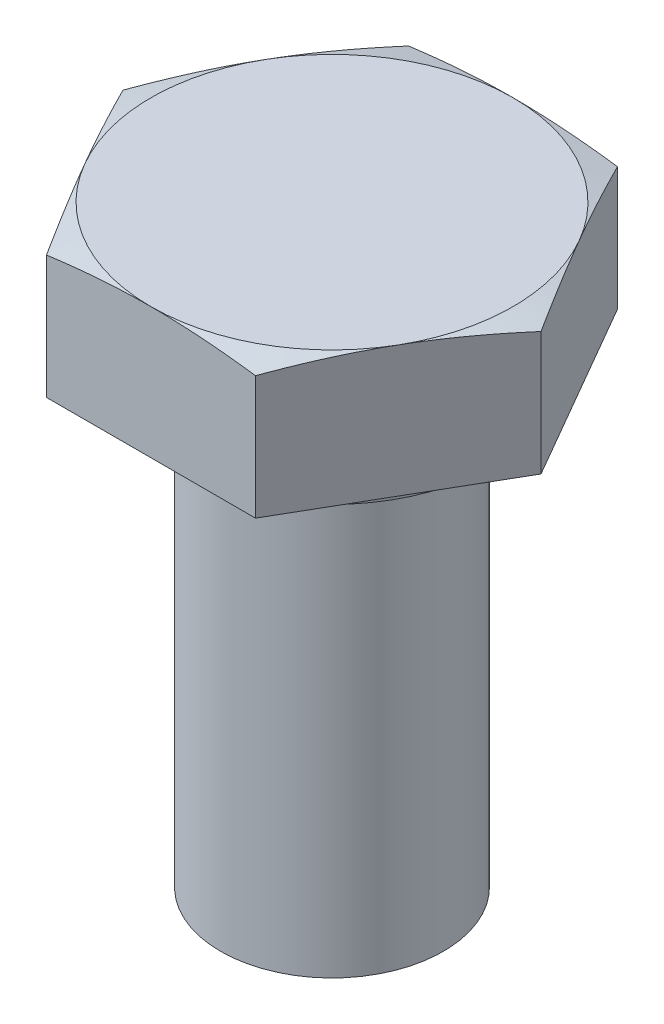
ISO-10303-21;
HEADER;
FILE_DESCRIPTION(('STEP AP214'),'2;1');
FILE_NAME('part.step','',(''),(''),'','','');
FILE_SCHEMA(('AUTOMOTIVE_DESIGN { 1 0 10303 214 1 1 1 1 }'));
ENDSEC;
DATA;
#1=APPLICATION_CONTEXT('core data for automotive mechanical design processes');
#2=APPLICATION_PROTOCOL_DEFINITION('international standard','automotive_design',2000,#1);
#3=PRODUCT_CONTEXT('',#1,'mechanical');
#4=PRODUCT('Part','Part','',(#3));
#5=PRODUCT_RELATED_PRODUCT_CATEGORY('part','',(#4));
#6=PRODUCT_DEFINITION_FORMATION('','',#4);
#7=PRODUCT_DEFINITION_CONTEXT('part definition',#1,'design');
#8=PRODUCT_DEFINITION('design','',#6,#7);
#9=PRODUCT_DEFINITION_SHAPE('','',#8);
#10=(LENGTH_UNIT() NAMED_UNIT(*) SI_UNIT(.MILLI.,.METRE.));
#11=(NAMED_UNIT(*) PLANE_ANGLE_UNIT() SI_UNIT($,.RADIAN.));
#12=(NAMED_UNIT(*) SI_UNIT($,.STERADIAN.) SOLID_ANGLE_UNIT());
#13=UNCERTAINTY_MEASURE_WITH_UNIT(LENGTH_MEASURE(1.E-05),#10,'distance_accuracy_value','');
#14=(GEOMETRIC_REPRESENTATION_CONTEXT(3) GLOBAL_UNCERTAINTY_ASSIGNED_CONTEXT((#13)) GLOBAL_UNIT_ASSIGNED_CONTEXT((#10,
#11,#12)) REPRESENTATION_CONTEXT('',''));
#15=CARTESIAN_POINT('',(0.,0.,0.));
#16=DIRECTION('',(0.,0.,1.));
#17=DIRECTION('',(1.,0.,0.));
#18=AXIS2_PLACEMENT_3D('',#15,#16,#17);
#19=CARTESIAN_POINT('',(7.8,0.,0.));
#20=DIRECTION('',(0.,1.,0.));
#21=DIRECTION('',(0.,0.,1.));
#22=AXIS2_PLACEMENT_3D('',#19,#20,#21);
#23=PLANE('',#22);
#24=CARTESIAN_POINT('',(0.,0.,0.));
#25=DIRECTION('',(0.,-1.,0.));
#26=DIRECTION('',(0.,0.,-1.));
#27=AXIS2_PLACEMENT_3D('',#24,#25,#26);
#28=CIRCLE('',#27,5.8);
#29=CARTESIAN_POINT('',(0.,0.,-5.8));
#30=VERTEX_POINT('',#29);
#31=EDGE_CURVE('E217',#30,#30,#28,.F.);
#32=ORIENTED_EDGE('',*,*,#31,.F.);
#33=EDGE_LOOP('',(#32));
#34=FACE_BOUND('',#33,.T.);
#35=CARTESIAN_POINT('',(0.,0.,0.));
#36=DIRECTION('',(0.,1.,0.));
#37=DIRECTION('',(0.,0.,1.));
#38=AXIS2_PLACEMENT_3D('',#35,#36,#37);
#39=CIRCLE('',#38,4.);
#40=CARTESIAN_POINT('',(0.,0.,4.));
#41=VERTEX_POINT('',#40);
#42=EDGE_CURVE('E11',#41,#41,#39,.T.);
#43=ORIENTED_EDGE('',*,*,#42,.T.);
#44=EDGE_LOOP('',(#43));
#45=FACE_BOUND('',#44,.T.);
#46=ADVANCED_FACE('F17',(#34,#45),#23,.F.);
#47=CARTESIAN_POINT('',(0.,5.3,0.));
#48=DIRECTION('',(0.,-1.,0.));
#49=DIRECTION('',(0.,0.,-1.));
#50=AXIS2_PLACEMENT_3D('',#47,#48,#49);
#51=PLANE('',#50);
#52=CARTESIAN_POINT('',(0.,5.2999999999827,0.));
#53=DIRECTION('',(0.,-1.,0.));
#54=DIRECTION('',(0.,0.,-1.));
#55=AXIS2_PLACEMENT_3D('',#52,#53,#54);
#56=CIRCLE('',#55,6.49999999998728);
#57=CARTESIAN_POINT('',(5.6291651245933,5.29999999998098,-3.2499999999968));
#58=VERTEX_POINT('',#57);
#59=CARTESIAN_POINT('',(5.6291651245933,5.29999999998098,3.24999999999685));
#60=VERTEX_POINT('',#59);
#61=EDGE_CURVE('E108',#58,#60,#56,.T.);
#62=ORIENTED_EDGE('',*,*,#61,.F.);
#63=CARTESIAN_POINT('',(0.,5.2999999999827,0.));
#64=DIRECTION('',(0.,-1.,0.));
#65=DIRECTION('',(0.,0.,-1.));
#66=AXIS2_PLACEMENT_3D('',#63,#64,#65);
#67=CIRCLE('',#66,6.49999999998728);
#68=CARTESIAN_POINT('',(0.,5.29999999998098,-6.49999999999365));
#69=VERTEX_POINT('',#68);
#70=EDGE_CURVE('E118',#69,#58,#67,.T.);
#71=ORIENTED_EDGE('',*,*,#70,.F.);
#72=CARTESIAN_POINT('',(0.,5.2999999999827,0.));
#73=DIRECTION('',(0.,-1.,0.));
#74=DIRECTION('',(0.,0.,-1.));
#75=AXIS2_PLACEMENT_3D('',#72,#73,#74);
#76=CIRCLE('',#75,6.49999999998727);
#77=CARTESIAN_POINT('',(-5.6291651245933,5.29999999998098,-3.2499999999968));
#78=VERTEX_POINT('',#77);
#79=EDGE_CURVE('E338',#78,#69,#76,.T.);
#80=ORIENTED_EDGE('',*,*,#79,.F.);
#81=CARTESIAN_POINT('',(0.,5.2999999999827,0.));
#82=DIRECTION('',(0.,-1.,0.));
#83=DIRECTION('',(0.,0.,-1.));
#84=AXIS2_PLACEMENT_3D('',#81,#82,#83);
#85=CIRCLE('',#84,6.49999999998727);
#86=CARTESIAN_POINT('',(-5.6291651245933,5.29999999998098,3.24999999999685));
#87=VERTEX_POINT('',#86);
#88=EDGE_CURVE('E339',#87,#78,#85,.T.);
#89=ORIENTED_EDGE('',*,*,#88,.F.);
#90=CARTESIAN_POINT('',(0.,5.2999999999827,0.));
#91=DIRECTION('',(0.,-1.,0.));
#92=DIRECTION('',(0.,0.,-1.));
#93=AXIS2_PLACEMENT_3D('',#90,#91,#92);
#94=CIRCLE('',#93,6.49999999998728);
#95=CARTESIAN_POINT('',(0.,5.29999999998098,6.49999999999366));
#96=VERTEX_POINT('',#95);
#97=EDGE_CURVE('E124',#96,#87,#94,.T.);
#98=ORIENTED_EDGE('',*,*,#97,.F.);
#99=CARTESIAN_POINT('',(0.,5.2999999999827,0.));
#100=DIRECTION('',(0.,-1.,0.));
#101=DIRECTION('',(0.,0.,-1.));
#102=AXIS2_PLACEMENT_3D('',#99,#100,#101);
#103=CIRCLE('',#102,6.49999999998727);
#104=EDGE_CURVE('E119',#60,#96,#103,.T.);
#105=ORIENTED_EDGE('',*,*,#104,.F.);
#106=EDGE_LOOP('',(#62,#71,#80,#89,#98,#105));
#107=FACE_BOUND('',#106,.T.);
#108=ADVANCED_FACE('F122',(#107),#51,.F.);
#109=CARTESIAN_POINT('',(0.,5.02894612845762,0.));
#110=DIRECTION('',(0.,-1.,0.));
#111=DIRECTION('',(0.,0.,-1.));
#112=AXIS2_PLACEMENT_3D('',#109,#110,#111);
#113=CONICAL_SURFACE('',#112,7.51158682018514,1.30899693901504);
#114=CARTESIAN_POINT('',(5.6291651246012,5.2999999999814,3.25000000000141));
#115=CARTESIAN_POINT('',(5.55066407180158,5.30000713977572,3.38596781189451));
#116=CARTESIAN_POINT('',(5.47216522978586,5.29847513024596,3.52193179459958));
#117=CARTESIAN_POINT('',(5.31519920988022,5.29239322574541,3.79380491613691));
#118=CARTESIAN_POINT('',(5.23673203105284,5.2878434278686,3.92971405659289));
#119=CARTESIAN_POINT('',(5.0015942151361,5.26977187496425,4.33698470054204));
#120=CARTESIAN_POINT('',(4.84500410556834,5.25182768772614,4.6082067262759));
#121=CARTESIAN_POINT('',(4.53227406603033,5.20524314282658,5.14987104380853));
#122=CARTESIAN_POINT('',(4.37613403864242,5.1766053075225,5.42031350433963));
#123=CARTESIAN_POINT('',(4.06416148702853,5.11011748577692,5.96066581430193));
#124=CARTESIAN_POINT('',(3.90832951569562,5.07225704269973,6.23057470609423));
#125=CARTESIAN_POINT('',(3.7527767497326,5.0305627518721,6.5));
#126=B_SPLINE_CURVE_WITH_KNOTS('',3,(#114,#115,#116,#117,#118,#119,#120,#121,#122,#123,#124,
#125),.UNSPECIFIED.,.F.,.F.,(4,2,2,2,2,4),(0.,0.470990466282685,0.94196577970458,
1.88281797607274,2.82344838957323,3.7651502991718),.UNSPECIFIED.);
#127=CARTESIAN_POINT('',(3.7527767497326,5.0305627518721,6.5));
#128=VERTEX_POINT('',#127);
#129=EDGE_CURVE('E131',#60,#128,#126,.T.);
#130=ORIENTED_EDGE('',*,*,#129,.F.);
#131=ORIENTED_EDGE('',*,*,#104,.T.);
#132=CARTESIAN_POINT('',(3.7527767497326,5.0305627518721,6.5));
#133=CARTESIAN_POINT('',(3.44167121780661,5.07225704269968,6.5));
#134=CARTESIAN_POINT('',(3.13000727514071,5.11011748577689,6.5));
#135=CARTESIAN_POINT('',(2.50606217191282,5.17660530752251,6.5));
#136=CARTESIAN_POINT('',(2.19378211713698,5.20524314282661,6.5));
#137=CARTESIAN_POINT('',(1.56832203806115,5.25182768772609,6.5));
#138=CARTESIAN_POINT('',(1.25514181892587,5.26977187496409,6.5));
#139=CARTESIAN_POINT('',(0.784866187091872,5.28784342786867,6.5));
#140=CARTESIAN_POINT('',(0.62793182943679,5.29239322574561,6.5));
#141=CARTESIAN_POINT('',(0.313999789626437,5.29847513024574,6.5));
#142=CARTESIAN_POINT('',(0.157002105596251,5.30000713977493,6.5));
#143=CARTESIAN_POINT('',(0.,5.29999999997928,6.5));
#144=B_SPLINE_CURVE_WITH_KNOTS('',3,(#132,#133,#134,#135,#136,#137,#138,#139,#140,#141,#142,
#143),.UNSPECIFIED.,.F.,.F.,(4,2,2,2,2,4),(0.,0.941701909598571,1.88233232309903,
2.82318451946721,3.29415983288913,3.76515029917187),.UNSPECIFIED.);
#145=EDGE_CURVE('E137',#128,#96,#144,.T.);
#146=ORIENTED_EDGE('',*,*,#145,.F.);
#147=EDGE_LOOP('',(#130,#131,#146));
#148=FACE_BOUND('',#147,.T.);
#149=ADVANCED_FACE('F136',(#148),#113,.T.);
#150=CARTESIAN_POINT('',(0.,5.02894612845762,0.));
#151=DIRECTION('',(0.,-1.,0.));
#152=DIRECTION('',(0.,0.,-1.));
#153=AXIS2_PLACEMENT_3D('',#150,#151,#152);
#154=CONICAL_SURFACE('',#153,7.51158682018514,1.30899693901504);
#155=CARTESIAN_POINT('',(5.6291651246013,5.2999999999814,-3.2500000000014));
#156=CARTESIAN_POINT('',(5.70766617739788,5.30000713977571,-3.11403218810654));
#157=CARTESIAN_POINT('',(5.78616501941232,5.29847513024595,-2.97806820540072));
#158=CARTESIAN_POINT('',(5.943131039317,5.29239322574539,-2.70619508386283));
#159=CARTESIAN_POINT('',(6.02159821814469,5.28784342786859,-2.57028594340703));
#160=CARTESIAN_POINT('',(6.25673603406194,5.26977187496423,-2.16301529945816));
#161=CARTESIAN_POINT('',(6.41332614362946,5.25182768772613,-1.89179327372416));
#162=CARTESIAN_POINT('',(6.72605618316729,5.20524314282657,-1.3501289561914));
#163=CARTESIAN_POINT('',(6.88219621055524,5.17660530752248,-1.07968649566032));
#164=CARTESIAN_POINT('',(7.19416876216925,5.11011748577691,-0.539334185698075));
#165=CARTESIAN_POINT('',(7.35000073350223,5.07225704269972,-0.269425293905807));
#166=CARTESIAN_POINT('',(7.5055534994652,5.0305627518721,0.));
#167=B_SPLINE_CURVE_WITH_KNOTS('',3,(#155,#156,#157,#158,#159,#160,#161,#162,#163,#164,#165,
#166),.UNSPECIFIED.,.F.,.F.,(4,2,2,2,2,4),(0.,0.470990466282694,0.941965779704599,
1.88281797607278,2.82344838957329,3.76515029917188),.UNSPECIFIED.);
#168=CARTESIAN_POINT('',(7.50555349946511,5.0305627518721,0.));
#169=VERTEX_POINT('',#168);
#170=EDGE_CURVE('E114',#58,#169,#167,.T.);
#171=ORIENTED_EDGE('',*,*,#170,.F.);
#172=ORIENTED_EDGE('',*,*,#61,.T.);
#173=CARTESIAN_POINT('',(7.50555349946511,5.0305627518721,0.));
#174=CARTESIAN_POINT('',(7.35000073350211,5.07225704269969,0.269425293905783));
#175=CARTESIAN_POINT('',(7.19416876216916,5.1101174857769,0.539334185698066));
#176=CARTESIAN_POINT('',(6.88219621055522,5.17660530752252,1.07968649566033));
#177=CARTESIAN_POINT('',(6.72605618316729,5.20524314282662,1.35012895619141));
#178=CARTESIAN_POINT('',(6.41332614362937,5.2518276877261,1.8917932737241));
#179=CARTESIAN_POINT('',(6.25673603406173,5.2697718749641,2.16301529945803));
#180=CARTESIAN_POINT('',(6.02159821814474,5.28784342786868,2.57028594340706));
#181=CARTESIAN_POINT('',(5.9431310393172,5.29239322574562,2.70619508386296));
#182=CARTESIAN_POINT('',(5.786165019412,5.29847513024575,2.97806820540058));
#183=CARTESIAN_POINT('',(5.70766617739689,5.30000713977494,3.11403218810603));
#184=CARTESIAN_POINT('',(5.6291651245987,5.29999999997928,3.25));
#185=B_SPLINE_CURVE_WITH_KNOTS('',3,(#173,#174,#175,#176,#177,#178,#179,#180,#181,#182,#183,
#184),.UNSPECIFIED.,.F.,.F.,(4,2,2,2,2,4),(0.,0.941701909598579,1.88233232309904,
2.82318451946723,3.29415983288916,3.7651502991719),.UNSPECIFIED.);
#186=EDGE_CURVE('E112',#169,#60,#185,.T.);
#187=ORIENTED_EDGE('',*,*,#186,.F.);
#188=EDGE_LOOP('',(#171,#172,#187));
#189=FACE_BOUND('',#188,.T.);
#190=ADVANCED_FACE('F110',(#189),#154,.T.);
#191=CARTESIAN_POINT('',(0.,5.02894612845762,0.));
#192=DIRECTION('',(0.,-1.,0.));
#193=DIRECTION('',(0.,0.,-1.));
#194=AXIS2_PLACEMENT_3D('',#191,#192,#193);
#195=CONICAL_SURFACE('',#194,7.51158682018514,1.30899693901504);
#196=CARTESIAN_POINT('',(0.,5.2999999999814,-6.50000000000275));
#197=CARTESIAN_POINT('',(0.157002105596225,5.30000713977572,-6.50000000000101));
#198=CARTESIAN_POINT('',(0.313999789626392,5.29847513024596,-6.50000000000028));
#199=CARTESIAN_POINT('',(0.627931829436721,5.2923932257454,-6.49999999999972));
#200=CARTESIAN_POINT('',(0.784866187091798,5.2878434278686,-6.4999999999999));
#201=CARTESIAN_POINT('',(1.25514181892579,5.26977187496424,-6.50000000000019));
#202=CARTESIAN_POINT('',(1.56832203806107,5.25182768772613,-6.50000000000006));
#203=CARTESIAN_POINT('',(2.19378211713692,5.20524314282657,-6.49999999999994));
#204=CARTESIAN_POINT('',(2.50606217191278,5.17660530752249,-6.49999999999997));
#205=CARTESIAN_POINT('',(3.1300072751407,5.11011748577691,-6.50000000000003));
#206=CARTESIAN_POINT('',(3.4416712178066,5.07225704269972,-6.50000000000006));
#207=CARTESIAN_POINT('',(3.7527767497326,5.0305627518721,-6.5));
#208=B_SPLINE_CURVE_WITH_KNOTS('',3,(#196,#197,#198,#199,#200,#201,#202,#203,#204,#205,#206,
#207),.UNSPECIFIED.,.F.,.F.,(4,2,2,2,2,4),(0.,0.470990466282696,0.941965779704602,
1.88281797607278,2.8234483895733,3.76515029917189),.UNSPECIFIED.);
#209=CARTESIAN_POINT('',(3.7527767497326,5.0305627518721,-6.5));
#210=VERTEX_POINT('',#209);
#211=EDGE_CURVE('E86',#69,#210,#208,.T.);
#212=ORIENTED_EDGE('',*,*,#211,.F.);
#213=ORIENTED_EDGE('',*,*,#70,.T.);
#214=CARTESIAN_POINT('',(3.7527767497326,5.0305627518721,-6.5));
#215=CARTESIAN_POINT('',(3.9083295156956,5.07225704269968,-6.23057470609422));
#216=CARTESIAN_POINT('',(4.06416148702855,5.11011748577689,-5.96066581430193));
#217=CARTESIAN_POINT('',(4.37613403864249,5.17660530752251,-5.42031350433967));
#218=CARTESIAN_POINT('',(4.53227406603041,5.20524314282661,-5.14987104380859));
#219=CARTESIAN_POINT('',(4.84500410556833,5.25182768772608,-4.6082067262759));
#220=CARTESIAN_POINT('',(5.00159421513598,5.26977187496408,-4.33698470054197));
#221=CARTESIAN_POINT('',(5.23673203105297,5.28784342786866,-3.92971405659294));
#222=CARTESIAN_POINT('',(5.31519920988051,5.29239322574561,-3.79380491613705));
#223=CARTESIAN_POINT('',(5.4721652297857,5.29847513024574,-3.52193179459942));
#224=CARTESIAN_POINT('',(5.55066407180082,5.30000713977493,-3.38596781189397));
#225=CARTESIAN_POINT('',(5.629165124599,5.29999999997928,-3.25));
#226=B_SPLINE_CURVE_WITH_KNOTS('',3,(#214,#215,#216,#217,#218,#219,#220,#221,#222,#223,#224,
#225),.UNSPECIFIED.,.F.,.F.,(4,2,2,2,2,4),(0.,0.941701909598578,1.88233232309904,
2.82318451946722,3.29415983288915,3.76515029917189),.UNSPECIFIED.);
#227=EDGE_CURVE('E139',#210,#58,#226,.T.);
#228=ORIENTED_EDGE('',*,*,#227,.F.);
#229=EDGE_LOOP('',(#212,#213,#228));
#230=FACE_BOUND('',#229,.T.);
#231=ADVANCED_FACE('F298',(#230),#195,.T.);
#232=CARTESIAN_POINT('',(0.,5.02894612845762,0.));
#233=DIRECTION('',(0.,-1.,0.));
#234=DIRECTION('',(0.,0.,-1.));
#235=AXIS2_PLACEMENT_3D('',#232,#233,#234);
#236=CONICAL_SURFACE('',#235,7.51158682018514,1.30899693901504);
#237=CARTESIAN_POINT('',(-5.6291651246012,5.2999999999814,-3.2500000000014));
#238=CARTESIAN_POINT('',(-5.5506640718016,5.30000713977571,-3.38596781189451));
#239=CARTESIAN_POINT('',(-5.47216522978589,5.29847513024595,-3.5219317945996));
#240=CARTESIAN_POINT('',(-5.31519920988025,5.2923932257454,-3.79380491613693));
#241=CARTESIAN_POINT('',(-5.23673203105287,5.28784342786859,-3.9297140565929));
#242=CARTESIAN_POINT('',(-5.00159421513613,5.26977187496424,-4.33698470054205));
#243=CARTESIAN_POINT('',(-4.84500410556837,5.25182768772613,-4.60820672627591));
#244=CARTESIAN_POINT('',(-4.53227406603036,5.20524314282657,-5.14987104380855));
#245=CARTESIAN_POINT('',(-4.37613403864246,5.17660530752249,-5.42031350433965));
#246=CARTESIAN_POINT('',(-4.06416148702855,5.11011748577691,-5.96066581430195));
#247=CARTESIAN_POINT('',(-3.90832951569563,5.07225704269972,-6.23057470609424));
#248=CARTESIAN_POINT('',(-3.7527767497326,5.0305627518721,-6.5));
#249=B_SPLINE_CURVE_WITH_KNOTS('',3,(#237,#238,#239,#240,#241,#242,#243,#244,#245,#246,#247,
#248),.UNSPECIFIED.,.F.,.F.,(4,2,2,2,2,4),(0.,0.470990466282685,0.941965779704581,
1.88281797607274,2.82344838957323,3.7651502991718),.UNSPECIFIED.);
#250=CARTESIAN_POINT('',(-3.7527767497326,5.0305627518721,-6.5));
#251=VERTEX_POINT('',#250);
#252=EDGE_CURVE('E235',#78,#251,#249,.T.);
#253=ORIENTED_EDGE('',*,*,#252,.F.);
#254=ORIENTED_EDGE('',*,*,#79,.T.);
#255=CARTESIAN_POINT('',(-3.7527767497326,5.0305627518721,-6.5));
#256=CARTESIAN_POINT('',(-3.4416712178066,5.07225704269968,-6.5));
#257=CARTESIAN_POINT('',(-3.13000727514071,5.11011748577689,-6.5));
#258=CARTESIAN_POINT('',(-2.50606217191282,5.17660530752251,-6.5));
#259=CARTESIAN_POINT('',(-2.19378211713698,5.20524314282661,-6.5));
#260=CARTESIAN_POINT('',(-1.56832203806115,5.25182768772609,-6.5));
#261=CARTESIAN_POINT('',(-1.25514181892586,5.26977187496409,-6.5));
#262=CARTESIAN_POINT('',(-0.784866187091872,5.28784342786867,-6.5));
#263=CARTESIAN_POINT('',(-0.627931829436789,5.29239322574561,-6.5));
#264=CARTESIAN_POINT('',(-0.313999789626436,5.29847513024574,-6.5));
#265=CARTESIAN_POINT('',(-0.157002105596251,5.30000713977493,-6.5));
#266=CARTESIAN_POINT('',(0.,5.29999999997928,-6.5));
#267=B_SPLINE_CURVE_WITH_KNOTS('',3,(#255,#256,#257,#258,#259,#260,#261,#262,#263,#264,#265,
#266),.UNSPECIFIED.,.F.,.F.,(4,2,2,2,2,4),(0.,0.94170190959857,1.88233232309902,2.8231845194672,
3.29415983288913,3.76515029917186),.UNSPECIFIED.);
#268=EDGE_CURVE('E265',#251,#69,#267,.T.);
#269=ORIENTED_EDGE('',*,*,#268,.F.);
#270=EDGE_LOOP('',(#253,#254,#269));
#271=FACE_BOUND('',#270,.T.);
#272=ADVANCED_FACE('F303',(#271),#236,.T.);
#273=CARTESIAN_POINT('',(0.,5.02894612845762,0.));
#274=DIRECTION('',(0.,-1.,0.));
#275=DIRECTION('',(0.,0.,-1.));
#276=AXIS2_PLACEMENT_3D('',#273,#274,#275);
#277=CONICAL_SURFACE('',#276,7.51158682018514,1.30899693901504);
#278=CARTESIAN_POINT('',(-5.6291651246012,5.2999999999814,3.25000000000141));
#279=CARTESIAN_POINT('',(-5.70766617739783,5.30000713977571,3.11403218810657));
#280=CARTESIAN_POINT('',(-5.78616501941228,5.29847513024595,2.97806820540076));
#281=CARTESIAN_POINT('',(-5.94313103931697,5.2923932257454,2.70619508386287));
#282=CARTESIAN_POINT('',(-6.02159821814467,5.28784342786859,2.57028594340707));
#283=CARTESIAN_POINT('',(-6.25673603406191,5.26977187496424,2.1630152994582));
#284=CARTESIAN_POINT('',(-6.41332614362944,5.25182768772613,1.8917932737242));
#285=CARTESIAN_POINT('',(-6.72605618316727,5.20524314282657,1.35012895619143));
#286=CARTESIAN_POINT('',(-6.88219621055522,5.17660530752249,1.07968649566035));
#287=CARTESIAN_POINT('',(-7.19416876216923,5.11011748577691,0.539334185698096));
#288=CARTESIAN_POINT('',(-7.3500007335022,5.07225704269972,0.26942529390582));
#289=CARTESIAN_POINT('',(-7.50555349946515,5.0305627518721,0.));
#290=B_SPLINE_CURVE_WITH_KNOTS('',3,(#278,#279,#280,#281,#282,#283,#284,#285,#286,#287,#288,
#289),.UNSPECIFIED.,.F.,.F.,(4,2,2,2,2,4),(0.,0.470990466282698,0.941965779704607,
1.88281797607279,2.82344838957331,3.76515029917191),.UNSPECIFIED.);
#291=CARTESIAN_POINT('',(-7.50555349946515,5.0305627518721,0.));
#292=VERTEX_POINT('',#291);
#293=EDGE_CURVE('E228',#87,#292,#290,.T.);
#294=ORIENTED_EDGE('',*,*,#293,.F.);
#295=ORIENTED_EDGE('',*,*,#88,.T.);
#296=CARTESIAN_POINT('',(-7.50555349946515,5.0305627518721,0.));
#297=CARTESIAN_POINT('',(-7.35000073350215,5.07225704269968,-0.269425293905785));
#298=CARTESIAN_POINT('',(-7.1941687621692,5.11011748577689,-0.53933418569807));
#299=CARTESIAN_POINT('',(-6.88219621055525,5.17660530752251,-1.07968649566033));
#300=CARTESIAN_POINT('',(-6.72605618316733,5.20524314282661,-1.35012895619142));
#301=CARTESIAN_POINT('',(-6.41332614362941,5.25182768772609,-1.89179327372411));
#302=CARTESIAN_POINT('',(-6.25673603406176,5.26977187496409,-2.16301529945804));
#303=CARTESIAN_POINT('',(-6.02159821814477,5.28784342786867,-2.57028594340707));
#304=CARTESIAN_POINT('',(-5.94313103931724,5.29239322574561,-2.70619508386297));
#305=CARTESIAN_POINT('',(-5.78616501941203,5.29847513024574,-2.9780682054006));
#306=CARTESIAN_POINT('',(-5.7076661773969,5.30000713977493,-3.11403218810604));
#307=CARTESIAN_POINT('',(-5.6291651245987,5.29999999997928,-3.25));
#308=B_SPLINE_CURVE_WITH_KNOTS('',3,(#296,#297,#298,#299,#300,#301,#302,#303,#304,#305,#306,
#307),.UNSPECIFIED.,.F.,.F.,(4,2,2,2,2,4),(0.,0.941701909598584,1.88233232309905,
2.82318451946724,3.29415983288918,3.76515029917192),.UNSPECIFIED.);
#309=EDGE_CURVE('E260',#292,#78,#308,.T.);
#310=ORIENTED_EDGE('',*,*,#309,.F.);
#311=EDGE_LOOP('',(#294,#295,#310));
#312=FACE_BOUND('',#311,.T.);
#313=ADVANCED_FACE('F345',(#312),#277,.T.);
#314=CARTESIAN_POINT('',(0.,5.02894612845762,0.));
#315=DIRECTION('',(0.,-1.,0.));
#316=DIRECTION('',(0.,0.,-1.));
#317=AXIS2_PLACEMENT_3D('',#314,#315,#316);
#318=CONICAL_SURFACE('',#317,7.51158682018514,1.30899693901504);
#319=ORIENTED_EDGE('',*,*,#97,.T.);
#320=CARTESIAN_POINT('',(-3.7527767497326,5.0305627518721,6.5));
#321=CARTESIAN_POINT('',(-3.90832951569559,5.07225704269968,6.23057470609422));
#322=CARTESIAN_POINT('',(-4.06416148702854,5.11011748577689,5.96066581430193));
#323=CARTESIAN_POINT('',(-4.37613403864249,5.17660530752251,5.42031350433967));
#324=CARTESIAN_POINT('',(-4.53227406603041,5.20524314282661,5.14987104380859));
#325=CARTESIAN_POINT('',(-4.84500410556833,5.25182768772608,4.6082067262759));
#326=CARTESIAN_POINT('',(-5.00159421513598,5.26977187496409,4.33698470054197));
#327=CARTESIAN_POINT('',(-5.23673203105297,5.28784342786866,3.92971405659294));
#328=CARTESIAN_POINT('',(-5.3151992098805,5.29239322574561,3.79380491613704));
#329=CARTESIAN_POINT('',(-5.4721652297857,5.29847513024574,3.52193179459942));
#330=CARTESIAN_POINT('',(-5.55066407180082,5.30000713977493,3.38596781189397));
#331=CARTESIAN_POINT('',(-5.629165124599,5.29999999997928,3.25));
#332=B_SPLINE_CURVE_WITH_KNOTS('',3,(#320,#321,#322,#323,#324,#325,#326,#327,#328,#329,#330,
#331),.UNSPECIFIED.,.F.,.F.,(4,2,2,2,2,4),(0.,0.941701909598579,1.88233232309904,
2.82318451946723,3.29415983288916,3.7651502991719),.UNSPECIFIED.);
#333=CARTESIAN_POINT('',(-3.7527767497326,5.0305627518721,6.5));
#334=VERTEX_POINT('',#333);
#335=EDGE_CURVE('E256',#334,#87,#332,.T.);
#336=ORIENTED_EDGE('',*,*,#335,.F.);
#337=CARTESIAN_POINT('',(0.,5.2999999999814,6.5000000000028));
#338=CARTESIAN_POINT('',(-0.157002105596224,5.30000713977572,6.50000000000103));
#339=CARTESIAN_POINT('',(-0.313999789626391,5.29847513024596,6.50000000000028));
#340=CARTESIAN_POINT('',(-0.62793182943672,5.2923932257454,6.49999999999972));
#341=CARTESIAN_POINT('',(-0.784866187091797,5.2878434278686,6.4999999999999));
#342=CARTESIAN_POINT('',(-1.25514181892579,5.26977187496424,6.5000000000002));
#343=CARTESIAN_POINT('',(-1.56832203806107,5.25182768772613,6.50000000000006));
#344=CARTESIAN_POINT('',(-2.19378211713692,5.20524314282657,6.49999999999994));
#345=CARTESIAN_POINT('',(-2.50606217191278,5.17660530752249,6.49999999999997));
#346=CARTESIAN_POINT('',(-3.13000727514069,5.11011748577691,6.50000000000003));
#347=CARTESIAN_POINT('',(-3.44167121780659,5.07225704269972,6.50000000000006));
#348=CARTESIAN_POINT('',(-3.7527767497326,5.0305627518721,6.5));
#349=B_SPLINE_CURVE_WITH_KNOTS('',3,(#337,#338,#339,#340,#341,#342,#343,#344,#345,#346,#347,
#348),.UNSPECIFIED.,.F.,.F.,(4,2,2,2,2,4),(0.,0.470990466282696,0.941965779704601,
1.88281797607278,2.82344838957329,3.76515029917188),.UNSPECIFIED.);
#350=EDGE_CURVE('E63',#96,#334,#349,.T.);
#351=ORIENTED_EDGE('',*,*,#350,.F.);
#352=EDGE_LOOP('',(#319,#336,#351));
#353=FACE_BOUND('',#352,.T.);
#354=ADVANCED_FACE('F159',(#353),#318,.T.);
#355=CARTESIAN_POINT('',(3.7527767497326,5.3,6.5));
#356=DIRECTION('',(0.,0.,1.));
#357=DIRECTION('',(1.,0.,0.));
#358=AXIS2_PLACEMENT_3D('',#355,#356,#357);
#359=PLANE('',#358);
#360=DIRECTION('',(0.,1.,0.));
#361=VECTOR('',#360,1.);
#362=CARTESIAN_POINT('',(3.7527767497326,5.3,6.5));
#363=LINE('',#362,#361);
#364=CARTESIAN_POINT('',(3.7527767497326,0.6,6.5));
#365=VERTEX_POINT('',#364);
#366=EDGE_CURVE('E171',#365,#128,#363,.T.);
#367=ORIENTED_EDGE('',*,*,#366,.T.);
#368=ORIENTED_EDGE('',*,*,#145,.T.);
#369=ORIENTED_EDGE('',*,*,#350,.T.);
#370=DIRECTION('',(0.,1.,0.));
#371=VECTOR('',#370,1.);
#372=CARTESIAN_POINT('',(-3.7527767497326,5.3,6.5));
#373=LINE('',#372,#371);
#374=CARTESIAN_POINT('',(-3.7527767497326,0.6,6.5));
#375=VERTEX_POINT('',#374);
#376=EDGE_CURVE('E55',#334,#375,#373,.F.);
#377=ORIENTED_EDGE('',*,*,#376,.T.);
#378=DIRECTION('',(1.,0.,0.));
#379=VECTOR('',#378,1.);
#380=CARTESIAN_POINT('',(7.8,0.6,6.5));
#381=LINE('',#380,#379);
#382=EDGE_CURVE('E134',#375,#365,#381,.T.);
#383=ORIENTED_EDGE('',*,*,#382,.T.);
#384=EDGE_LOOP('',(#367,#368,#369,#377,#383));
#385=FACE_BOUND('',#384,.T.);
#386=ADVANCED_FACE('F179',(#385),#359,.T.);
#387=CARTESIAN_POINT('',(7.50555349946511,5.3,0.));
#388=DIRECTION('',(0.866025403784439,0.,0.5));
#389=DIRECTION('',(0.5,0.,-0.866025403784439));
#390=AXIS2_PLACEMENT_3D('',#387,#388,#389);
#391=PLANE('',#390);
#392=DIRECTION('',(0.,1.,0.));
#393=VECTOR('',#392,1.);
#394=CARTESIAN_POINT('',(7.50555349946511,5.3,0.));
#395=LINE('',#394,#393);
#396=CARTESIAN_POINT('',(7.50555349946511,0.6,0.));
#397=VERTEX_POINT('',#396);
#398=EDGE_CURVE('E133',#169,#397,#395,.F.);
#399=ORIENTED_EDGE('',*,*,#398,.F.);
#400=ORIENTED_EDGE('',*,*,#186,.T.);
#401=ORIENTED_EDGE('',*,*,#129,.T.);
#402=ORIENTED_EDGE('',*,*,#366,.F.);
#403=DIRECTION('',(0.5,0.,-0.86602540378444));
#404=VECTOR('',#403,1.);
#405=CARTESIAN_POINT('',(3.7527767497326,0.6,6.5));
#406=LINE('',#405,#404);
#407=EDGE_CURVE('E32',#365,#397,#406,.T.);
#408=ORIENTED_EDGE('',*,*,#407,.T.);
#409=EDGE_LOOP('',(#399,#400,#401,#402,#408));
#410=FACE_BOUND('',#409,.T.);
#411=ADVANCED_FACE('F130',(#410),#391,.T.);
#412=CARTESIAN_POINT('',(3.7527767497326,5.3,-6.5));
#413=DIRECTION('',(0.866025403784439,0.,-0.5));
#414=DIRECTION('',(-0.5,0.,-0.866025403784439));
#415=AXIS2_PLACEMENT_3D('',#412,#413,#414);
#416=PLANE('',#415);
#417=DIRECTION('',(0.,1.,0.));
#418=VECTOR('',#417,1.);
#419=CARTESIAN_POINT('',(3.7527767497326,5.3,-6.5));
#420=LINE('',#419,#418);
#421=CARTESIAN_POINT('',(3.7527767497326,0.6,-6.5));
#422=VERTEX_POINT('',#421);
#423=EDGE_CURVE('E80',#210,#422,#420,.F.);
#424=ORIENTED_EDGE('',*,*,#423,.F.);
#425=ORIENTED_EDGE('',*,*,#227,.T.);
#426=ORIENTED_EDGE('',*,*,#170,.T.);
#427=ORIENTED_EDGE('',*,*,#398,.T.);
#428=DIRECTION('',(-0.5,0.,-0.86602540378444));
#429=VECTOR('',#428,1.);
#430=CARTESIAN_POINT('',(7.50555349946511,0.6,0.));
#431=LINE('',#430,#429);
#432=EDGE_CURVE('E243',#397,#422,#431,.T.);
#433=ORIENTED_EDGE('',*,*,#432,.T.);
#434=EDGE_LOOP('',(#424,#425,#426,#427,#433));
#435=FACE_BOUND('',#434,.T.);
#436=ADVANCED_FACE('F281',(#435),#416,.T.);
#437=CARTESIAN_POINT('',(-3.7527767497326,5.3,-6.5));
#438=DIRECTION('',(0.,0.,-1.));
#439=DIRECTION('',(-1.,0.,0.));
#440=AXIS2_PLACEMENT_3D('',#437,#438,#439);
#441=PLANE('',#440);
#442=DIRECTION('',(0.,1.,0.));
#443=VECTOR('',#442,1.);
#444=CARTESIAN_POINT('',(-3.7527767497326,5.3,-6.5));
#445=LINE('',#444,#443);
#446=CARTESIAN_POINT('',(-3.7527767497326,0.6,-6.5));
#447=VERTEX_POINT('',#446);
#448=EDGE_CURVE('E231',#251,#447,#445,.F.);
#449=ORIENTED_EDGE('',*,*,#448,.F.);
#450=ORIENTED_EDGE('',*,*,#268,.T.);
#451=ORIENTED_EDGE('',*,*,#211,.T.);
#452=ORIENTED_EDGE('',*,*,#423,.T.);
#453=DIRECTION('',(1.,0.,0.));
#454=VECTOR('',#453,1.);
#455=CARTESIAN_POINT('',(7.8,0.6,-6.5));
#456=LINE('',#455,#454);
#457=EDGE_CURVE('E239',#422,#447,#456,.F.);
#458=ORIENTED_EDGE('',*,*,#457,.T.);
#459=EDGE_LOOP('',(#449,#450,#451,#452,#458));
#460=FACE_BOUND('',#459,.T.);
#461=ADVANCED_FACE('F279',(#460),#441,.T.);
#462=CARTESIAN_POINT('',(-7.50555349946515,5.3,0.));
#463=DIRECTION('',(-0.866025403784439,0.,-0.5));
#464=DIRECTION('',(-0.5,0.,0.866025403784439));
#465=AXIS2_PLACEMENT_3D('',#462,#463,#464);
#466=PLANE('',#465);
#467=DIRECTION('',(0.,1.,0.));
#468=VECTOR('',#467,1.);
#469=CARTESIAN_POINT('',(-7.50555349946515,5.3,0.));
#470=LINE('',#469,#468);
#471=CARTESIAN_POINT('',(-7.50555349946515,0.6,0.));
#472=VERTEX_POINT('',#471);
#473=EDGE_CURVE('E41',#292,#472,#470,.F.);
#474=ORIENTED_EDGE('',*,*,#473,.F.);
#475=ORIENTED_EDGE('',*,*,#309,.T.);
#476=ORIENTED_EDGE('',*,*,#252,.T.);
#477=ORIENTED_EDGE('',*,*,#448,.T.);
#478=DIRECTION('',(-0.5,0.,0.866025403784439));
#479=VECTOR('',#478,1.);
#480=CARTESIAN_POINT('',(-3.7527767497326,0.6,-6.5));
#481=LINE('',#480,#479);
#482=EDGE_CURVE('E234',#447,#472,#481,.T.);
#483=ORIENTED_EDGE('',*,*,#482,.T.);
#484=EDGE_LOOP('',(#474,#475,#476,#477,#483));
#485=FACE_BOUND('',#484,.T.);
#486=ADVANCED_FACE('F274',(#485),#466,.T.);
#487=CARTESIAN_POINT('',(-3.7527767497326,5.3,6.5));
#488=DIRECTION('',(-0.866025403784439,0.,0.5));
#489=DIRECTION('',(0.5,0.,0.866025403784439));
#490=AXIS2_PLACEMENT_3D('',#487,#488,#489);
#491=PLANE('',#490);
#492=ORIENTED_EDGE('',*,*,#376,.F.);
#493=ORIENTED_EDGE('',*,*,#335,.T.);
#494=ORIENTED_EDGE('',*,*,#293,.T.);
#495=ORIENTED_EDGE('',*,*,#473,.T.);
#496=DIRECTION('',(0.5,0.,0.866025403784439));
#497=VECTOR('',#496,1.);
#498=CARTESIAN_POINT('',(-7.50555349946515,0.6,0.));
#499=LINE('',#498,#497);
#500=EDGE_CURVE('E227',#472,#375,#499,.T.);
#501=ORIENTED_EDGE('',*,*,#500,.T.);
#502=EDGE_LOOP('',(#492,#493,#494,#495,#501));
#503=FACE_BOUND('',#502,.T.);
#504=ADVANCED_FACE('F184',(#503),#491,.T.);
#505=CARTESIAN_POINT('',(7.8,0.6,0.));
#506=DIRECTION('',(0.,1.,0.));
#507=DIRECTION('',(0.,0.,1.));
#508=AXIS2_PLACEMENT_3D('',#505,#506,#507);
#509=PLANE('',#508);
#510=CARTESIAN_POINT('',(0.,0.60000000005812,0.));
#511=DIRECTION('',(0.,1.,0.));
#512=DIRECTION('',(0.,0.,1.));
#513=AXIS2_PLACEMENT_3D('',#510,#511,#512);
#514=CIRCLE('',#513,6.29999999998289);
#515=CARTESIAN_POINT('',(0.,0.60000000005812,6.29999999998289));
#516=VERTEX_POINT('',#515);
#517=EDGE_CURVE('E177',#516,#516,#514,.F.);
#518=ORIENTED_EDGE('',*,*,#517,.F.);
#519=EDGE_LOOP('',(#518));
#520=FACE_BOUND('',#519,.T.);
#521=ORIENTED_EDGE('',*,*,#500,.F.);
#522=ORIENTED_EDGE('',*,*,#482,.F.);
#523=ORIENTED_EDGE('',*,*,#457,.F.);
#524=ORIENTED_EDGE('',*,*,#432,.F.);
#525=ORIENTED_EDGE('',*,*,#407,.F.);
#526=ORIENTED_EDGE('',*,*,#382,.F.);
#527=EDGE_LOOP('',(#521,#522,#523,#524,#525,#526));
#528=FACE_BOUND('',#527,.T.);
#529=ADVANCED_FACE('F187',(#520,#528),#509,.F.);
#530=CARTESIAN_POINT('',(0.,0.60000000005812,0.));
#531=DIRECTION('',(0.,1.,0.));
#532=DIRECTION('',(0.,0.,1.));
#533=AXIS2_PLACEMENT_3D('',#530,#531,#532);
#534=CONICAL_SURFACE('',#533,6.29999999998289,0.785398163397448);
#535=ORIENTED_EDGE('',*,*,#517,.T.);
#536=EDGE_LOOP('',(#535));
#537=FACE_BOUND('',#536,.T.);
#538=CARTESIAN_POINT('',(0.,0.1,0.));
#539=DIRECTION('',(0.,-1.,0.));
#540=DIRECTION('',(0.,0.,-1.));
#541=AXIS2_PLACEMENT_3D('',#538,#539,#540);
#542=CIRCLE('',#541,5.8);
#543=CARTESIAN_POINT('',(0.,0.1,-5.8));
#544=VERTEX_POINT('',#543);
#545=EDGE_CURVE('E215',#544,#544,#542,.T.);
#546=ORIENTED_EDGE('',*,*,#545,.F.);
#547=EDGE_LOOP('',(#546));
#548=FACE_BOUND('',#547,.T.);
#549=ADVANCED_FACE('F191',(#537,#548),#534,.T.);
#550=CARTESIAN_POINT('',(0.,-16.,0.));
#551=DIRECTION('',(0.,-1.,0.));
#552=DIRECTION('',(0.,0.,-1.));
#553=AXIS2_PLACEMENT_3D('',#550,#551,#552);
#554=CYLINDRICAL_SURFACE('',#553,5.8);
#555=ORIENTED_EDGE('',*,*,#31,.T.);
#556=EDGE_LOOP('',(#555));
#557=FACE_BOUND('',#556,.T.);
#558=ORIENTED_EDGE('',*,*,#545,.T.);
#559=EDGE_LOOP('',(#558));
#560=FACE_BOUND('',#559,.T.);
#561=ADVANCED_FACE('F195',(#557,#560),#554,.T.);
#562=CARTESIAN_POINT('',(3.233,-16.,0.));
#563=DIRECTION('',(0.,1.,0.));
#564=DIRECTION('',(0.,0.,1.));
#565=AXIS2_PLACEMENT_3D('',#562,#563,#564);
#566=PLANE('',#565);
#567=CARTESIAN_POINT('',(0.,-16.,0.));
#568=DIRECTION('',(0.,1.,0.));
#569=DIRECTION('',(0.,0.,1.));
#570=AXIS2_PLACEMENT_3D('',#567,#568,#569);
#571=CIRCLE('',#570,4.);
#572=CARTESIAN_POINT('',(0.,-16.,4.));
#573=VERTEX_POINT('',#572);
#574=EDGE_CURVE('E25',#573,#573,#571,.T.);
#575=ORIENTED_EDGE('',*,*,#574,.F.);
#576=EDGE_LOOP('',(#575));
#577=FACE_BOUND('',#576,.T.);
#578=ADVANCED_FACE('F19',(#577),#566,.F.);
#579=CARTESIAN_POINT('',(0.,-16.,0.));
#580=DIRECTION('',(0.,-1.,0.));
#581=DIRECTION('',(0.,0.,-1.));
#582=AXIS2_PLACEMENT_3D('',#579,#580,#581);
#583=CYLINDRICAL_SURFACE('',#582,4.);
#584=ORIENTED_EDGE('',*,*,#42,.F.);
#585=EDGE_LOOP('',(#584));
#586=FACE_BOUND('',#585,.T.);
#587=ORIENTED_EDGE('',*,*,#574,.T.);
#588=EDGE_LOOP('',(#587));
#589=FACE_BOUND('',#588,.T.);
#590=ADVANCED_FACE('F202',(#586,#589),#583,.T.);
#591=CLOSED_SHELL('',(#46,#108,#149,#190,#231,#272,#313,#354,#386,#411,#436,#461,#486,#504,#529,
#549,#561,#578,#590));
#592=MANIFOLD_SOLID_BREP('B1',#591);
#593=ADVANCED_BREP_SHAPE_REPRESENTATION('',(#18,#592),#14);
#594=SHAPE_DEFINITION_REPRESENTATION(#9,#593);
ENDSEC;
END-ISO-10303-21;
